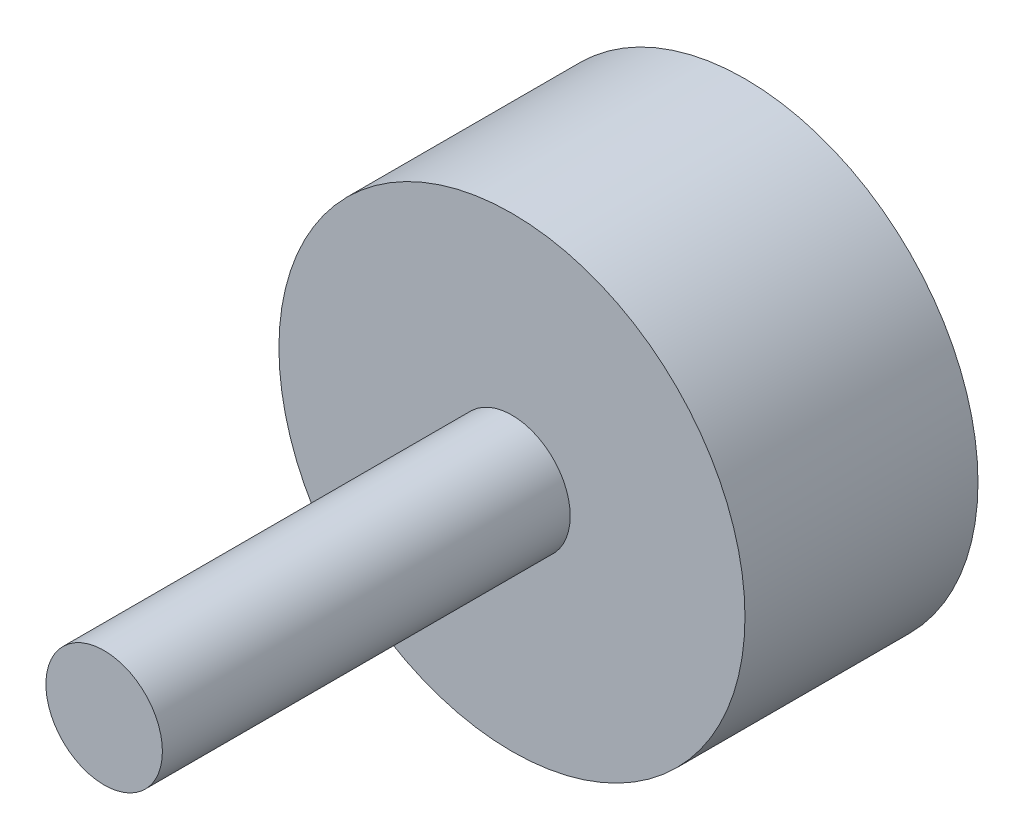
ISO-10303-21;
HEADER;
FILE_DESCRIPTION(('STEP AP214'),'2;1');
FILE_NAME('part.step','',(''),(''),'','','');
FILE_SCHEMA(('AUTOMOTIVE_DESIGN { 1 0 10303 214 1 1 1 1 }'));
ENDSEC;
DATA;
#1=APPLICATION_CONTEXT('core data for automotive mechanical design processes');
#2=APPLICATION_PROTOCOL_DEFINITION('international standard','automotive_design',2000,#1);
#3=PRODUCT_CONTEXT('',#1,'mechanical');
#4=PRODUCT('Part','Part','',(#3));
#5=PRODUCT_RELATED_PRODUCT_CATEGORY('part','',(#4));
#6=PRODUCT_DEFINITION_FORMATION('','',#4);
#7=PRODUCT_DEFINITION_CONTEXT('part definition',#1,'design');
#8=PRODUCT_DEFINITION('design','',#6,#7);
#9=PRODUCT_DEFINITION_SHAPE('','',#8);
#10=(LENGTH_UNIT() NAMED_UNIT(*) SI_UNIT(.MILLI.,.METRE.));
#11=(NAMED_UNIT(*) PLANE_ANGLE_UNIT() SI_UNIT($,.RADIAN.));
#12=(NAMED_UNIT(*) SI_UNIT($,.STERADIAN.) SOLID_ANGLE_UNIT());
#13=UNCERTAINTY_MEASURE_WITH_UNIT(LENGTH_MEASURE(1.E-05),#10,'distance_accuracy_value','');
#14=(GEOMETRIC_REPRESENTATION_CONTEXT(3) GLOBAL_UNCERTAINTY_ASSIGNED_CONTEXT((#13)) GLOBAL_UNIT_ASSIGNED_CONTEXT((#10,
#11,#12)) REPRESENTATION_CONTEXT('',''));
#15=CARTESIAN_POINT('',(0.,0.,0.));
#16=DIRECTION('',(0.,0.,1.));
#17=DIRECTION('',(1.,0.,0.));
#18=AXIS2_PLACEMENT_3D('',#15,#16,#17);
#19=CARTESIAN_POINT('',(0.,0.,12.7));
#20=DIRECTION('',(0.,0.,-1.));
#21=DIRECTION('',(-1.,0.,0.));
#22=AXIS2_PLACEMENT_3D('',#19,#20,#21);
#23=CYLINDRICAL_SURFACE('',#22,12.7);
#24=CARTESIAN_POINT('',(0.,0.,12.7));
#25=DIRECTION('',(0.,0.,1.));
#26=DIRECTION('',(1.,0.,0.));
#27=AXIS2_PLACEMENT_3D('',#24,#25,#26);
#28=CIRCLE('',#27,12.7);
#29=CARTESIAN_POINT('',(12.7,0.,12.7));
#30=VERTEX_POINT('',#29);
#31=EDGE_CURVE('E45',#30,#30,#28,.T.);
#32=ORIENTED_EDGE('',*,*,#31,.F.);
#33=EDGE_LOOP('',(#32));
#34=FACE_BOUND('',#33,.T.);
#35=CARTESIAN_POINT('',(0.,0.,0.));
#36=DIRECTION('',(0.,0.,1.));
#37=DIRECTION('',(1.,0.,0.));
#38=AXIS2_PLACEMENT_3D('',#35,#36,#37);
#39=CIRCLE('',#38,12.7);
#40=CARTESIAN_POINT('',(12.7,0.,0.));
#41=VERTEX_POINT('',#40);
#42=EDGE_CURVE('E40',#41,#41,#39,.T.);
#43=ORIENTED_EDGE('',*,*,#42,.T.);
#44=EDGE_LOOP('',(#43));
#45=FACE_BOUND('',#44,.T.);
#46=ADVANCED_FACE('F37',(#34,#45),#23,.T.);
#47=CARTESIAN_POINT('',(0.,0.,12.7));
#48=DIRECTION('',(0.,0.,1.));
#49=DIRECTION('',(1.,0.,0.));
#50=AXIS2_PLACEMENT_3D('',#47,#48,#49);
#51=PLANE('',#50);
#52=CARTESIAN_POINT('',(0.,0.,12.7));
#53=DIRECTION('',(0.,0.,1.));
#54=DIRECTION('',(1.,0.,0.));
#55=AXIS2_PLACEMENT_3D('',#52,#53,#54);
#56=CIRCLE('',#55,3.175);
#57=CARTESIAN_POINT('',(3.175,0.,12.7));
#58=VERTEX_POINT('',#57);
#59=EDGE_CURVE('E10',#58,#58,#56,.T.);
#60=ORIENTED_EDGE('',*,*,#59,.F.);
#61=EDGE_LOOP('',(#60));
#62=FACE_BOUND('',#61,.T.);
#63=ORIENTED_EDGE('',*,*,#31,.T.);
#64=EDGE_LOOP('',(#63));
#65=FACE_BOUND('',#64,.T.);
#66=ADVANCED_FACE('F65',(#62,#65),#51,.T.);
#67=CARTESIAN_POINT('',(0.,0.,0.));
#68=DIRECTION('',(0.,0.,1.));
#69=DIRECTION('',(1.,0.,0.));
#70=AXIS2_PLACEMENT_3D('',#67,#68,#69);
#71=PLANE('',#70);
#72=ORIENTED_EDGE('',*,*,#42,.F.);
#73=EDGE_LOOP('',(#72));
#74=FACE_BOUND('',#73,.T.);
#75=ADVANCED_FACE('F62',(#74),#71,.F.);
#76=CARTESIAN_POINT('',(0.,0.,34.925));
#77=DIRECTION('',(0.,0.,-1.));
#78=DIRECTION('',(-1.,0.,0.));
#79=AXIS2_PLACEMENT_3D('',#76,#77,#78);
#80=CYLINDRICAL_SURFACE('',#79,3.175);
#81=CARTESIAN_POINT('',(0.,0.,34.925));
#82=DIRECTION('',(0.,0.,1.));
#83=DIRECTION('',(1.,0.,0.));
#84=AXIS2_PLACEMENT_3D('',#81,#82,#83);
#85=CIRCLE('',#84,3.175);
#86=CARTESIAN_POINT('',(3.175,0.,34.925));
#87=VERTEX_POINT('',#86);
#88=EDGE_CURVE('E52',#87,#87,#85,.T.);
#89=ORIENTED_EDGE('',*,*,#88,.F.);
#90=EDGE_LOOP('',(#89));
#91=FACE_BOUND('',#90,.T.);
#92=ORIENTED_EDGE('',*,*,#59,.T.);
#93=EDGE_LOOP('',(#92));
#94=FACE_BOUND('',#93,.T.);
#95=ADVANCED_FACE('F64',(#91,#94),#80,.T.);
#96=CARTESIAN_POINT('',(0.,0.,34.925));
#97=DIRECTION('',(0.,0.,1.));
#98=DIRECTION('',(1.,0.,0.));
#99=AXIS2_PLACEMENT_3D('',#96,#97,#98);
#100=PLANE('',#99);
#101=ORIENTED_EDGE('',*,*,#88,.T.);
#102=EDGE_LOOP('',(#101));
#103=FACE_BOUND('',#102,.T.);
#104=ADVANCED_FACE('F70',(#103),#100,.T.);
#105=CLOSED_SHELL('',(#46,#66,#75,#95,#104));
#106=MANIFOLD_SOLID_BREP('B2',#105);
#107=ADVANCED_BREP_SHAPE_REPRESENTATION('',(#18,#106),#14);
#108=SHAPE_DEFINITION_REPRESENTATION(#9,#107);
ENDSEC;
END-ISO-10303-21;
